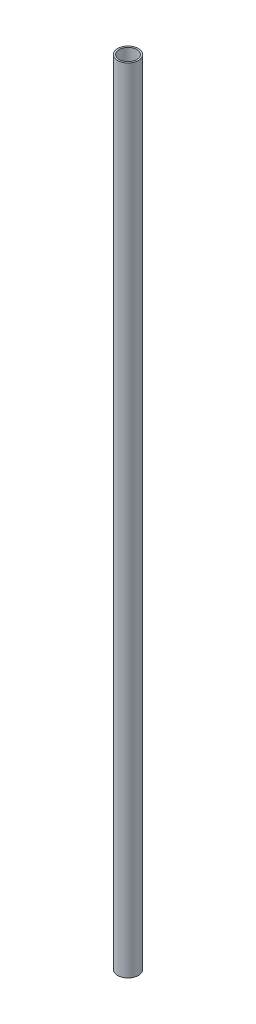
from build123d import *

# Parameters (mm, degrees)
SKETCH1_R           = 12.5
SKETCH1_R_2         = 10.5
BOSS_EXTRUDE1_DEPTH = 950


with BuildPart() as part:
    # Sketch1 → Boss-Extrude1 (new body)
    with BuildSketch(Plane(origin=(0, 0, 0), x_dir=(1, 0, 0), z_dir=(0, 1, 0))):
        with Locations(Location((0, 0, 0), (0, 0, 90))):
            Circle(SKETCH1_R)
        with Locations(Location((0, 0, 0), (0, 0, 90))):
            Circle(SKETCH1_R_2, mode=Mode.SUBTRACT)
    extrude(amount=BOSS_EXTRUDE1_DEPTH)


solid = part.part
